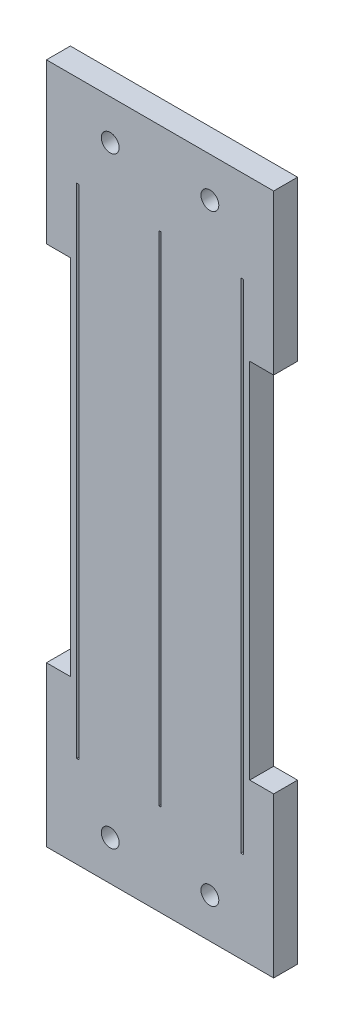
from build123d import *

# Parameters (mm, degrees)
ESQUISSE1_W               = 45
ESQUISSE1_H               = 171
BOSS_EXTRU_1_DEPTH        = 6
ESQUISSE2_W               = 6
ESQUISSE2_H               = 40
BOSS_EXTRU_2_DEPTH        = 6
ESQUISSE4_R               = 2.234668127
ENL_V_MAT_EXTRU_1_DEPTH   = 6
SYM_TRIE3_COPY_1_SKETCH_W = 6
SYM_TRIE3_COPY_1_SKETCH_H = 40
SYM_TRIE3_COPY_1_DEPTH    = 6
SYM_TRIE5_COPY_1_SKETCH_R = 2.234668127
SYM_TRIE5_COPY_1_DEPTH    = 6
SYM_TRIE5_COPY_2_SKETCH_R = 2.234668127
SYM_TRIE5_COPY_2_DEPTH    = 6
ESQUISSE5_W               = 0.6
ESQUISSE5_H               = 125
ENL_V_MAT_EXTRU_2_DEPTH   = 10


with BuildPart() as part:
    # Esquisse1 → Boss.-Extru.1 (new body)
    with BuildSketch(Plane.XY):
        Rectangle(ESQUISSE1_W, ESQUISSE1_H)
    extrude(amount=BOSS_EXTRU_1_DEPTH)

    # Esquisse2 → Boss.-Extru.2 (add)
    with BuildSketch(Plane.XY.offset(6)):
        with Locations((-25.5, 65.5)):
            Rectangle(ESQUISSE2_W, ESQUISSE2_H)
    boss_extru_2 = extrude(amount=-BOSS_EXTRU_2_DEPTH)

    # Esquisse4 → Enl_v. mat.-Extru.1 (cut)
    with BuildSketch(Plane.XY.offset(6)):
        with Locations((-12.5, -75.5)):
            Circle(ESQUISSE4_R)
    enl_v_mat_extru_1 = extrude(amount=-ENL_V_MAT_EXTRU_1_DEPTH, mode=Mode.SUBTRACT)

    # Sym_trie1: Enl_v. mat.-Extru.1 across plane
    add(enl_v_mat_extru_1.mirror(Plane(origin=(0, 0, 0), x_dir=(0, 0, 1), z_dir=(1, 0, 0))), mode=Mode.SUBTRACT)

    # Sym_trie2: Boss.-Extru.2 across plane
    add(boss_extru_2.mirror(Plane(origin=(0, 0, 0), x_dir=(0, 0, 1), z_dir=(1, 0, 0))))

    # Sym_trie3: Boss.-Extru.2 across plane
    add(boss_extru_2.mirror(Plane.ZX))

    # Sym_trie3 copy 1 sketch → Sym_trie3 copy 1 (add)
    with BuildSketch(Plane(origin=(0, 0, 6), x_dir=(-1, 0, 0), z_dir=(0, 0, 1))):
        with Locations((-25.5, 65.5)):
            Rectangle(SYM_TRIE3_COPY_1_SKETCH_W, SYM_TRIE3_COPY_1_SKETCH_H)
    extrude(amount=-SYM_TRIE3_COPY_1_DEPTH)

    # Sym_trie4: Enl_v. mat.-Extru.1 across plane
    add(enl_v_mat_extru_1.mirror(Plane.ZX), mode=Mode.SUBTRACT)

    # Sym_trie5 copy 1 sketch → Sym_trie5 copy 1 (cut)
    with BuildSketch(Plane(origin=(0, 0, 6), x_dir=(-1, 0, 0), z_dir=(0, 0, 1))):
        with Locations((-12.5, -75.5)):
            Circle(SYM_TRIE5_COPY_1_SKETCH_R)
    extrude(amount=-SYM_TRIE5_COPY_1_DEPTH, mode=Mode.SUBTRACT)

    # Sym_trie5 copy 2 sketch → Sym_trie5 copy 2 (cut)
    with BuildSketch(Plane(origin=(0, 0, 6), x_dir=(-1, 0, 0), z_dir=(0, 0, 1))):
        with Locations((-12.5, 75.5)):
            Circle(SYM_TRIE5_COPY_2_SKETCH_R)
    extrude(amount=-SYM_TRIE5_COPY_2_DEPTH, mode=Mode.SUBTRACT)

    # Esquisse5 → Enl_v. mat.-Extru.2 (cut)
    with BuildSketch(Plane.XY.offset(6)):
        Rectangle(ESQUISSE5_W, ESQUISSE5_H)
        with Locations((-20.6, 0)):
            Rectangle(ESQUISSE5_W, ESQUISSE5_H)
    enl_v_mat_extru_2 = extrude(amount=-ENL_V_MAT_EXTRU_2_DEPTH, mode=Mode.SUBTRACT)

    # Sym_trie6: Enl_v. mat.-Extru.2 across plane
    add(enl_v_mat_extru_2.mirror(Plane(origin=(0, 0, 0), x_dir=(0, 0, 1), z_dir=(1, 0, 0))), mode=Mode.SUBTRACT)


solid = part.part
